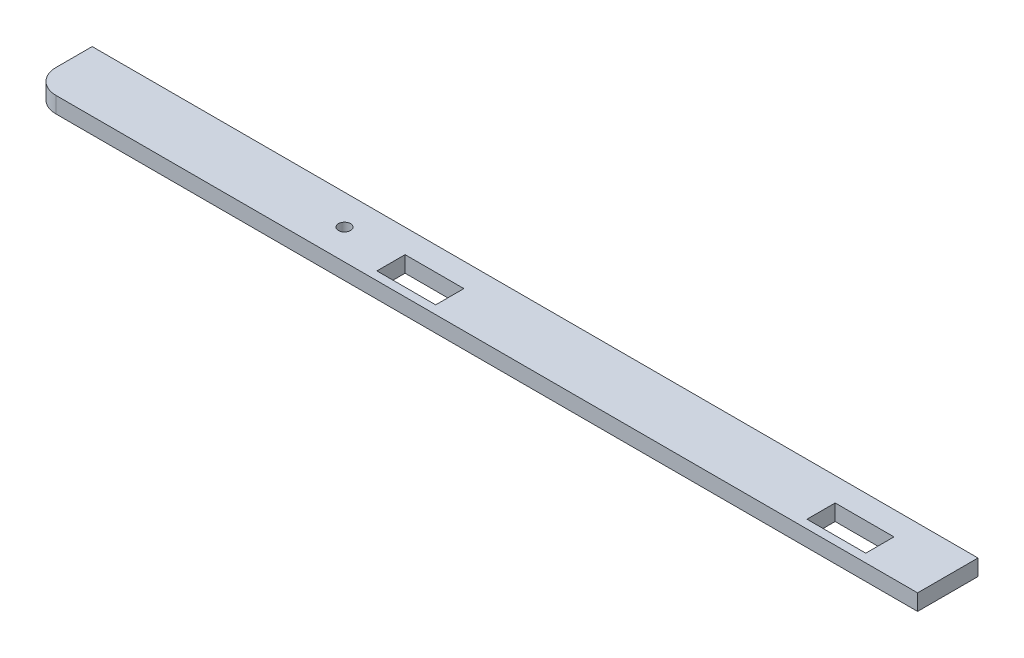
from build123d import *

# Parameters (mm, degrees)
SKETCH1_W           = 219.970675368
SKETCH1_H           = 15
SKETCH1_R           = 1.5
BOSS_EXTRUDE1_DEPTH = 4
SKETCH4_W           = 14.6
SKETCH4_H           = 7
CUT_EXTRUDE3_DEPTH  = 186.844020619
SKETCH5_W           = 14.6
SKETCH5_H           = 7
CUT_EXTRUDE4_DEPTH  = 186.844020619
FILLET1_R           = 6


with BuildPart() as part:
    # Sketch1 → Boss-Extrude1 (new body)
    with BuildSketch(Plane(origin=(0, 3, 0), x_dir=(1, 0, 0), z_dir=(0, 1, 0))):
        with Locations((-31.014662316, -113.5)):
            Rectangle(SKETCH1_W, SKETCH1_H)
        with Locations(Location((-70.85, -113.5, 0), (0, 0, 270))):
            Circle(SKETCH1_R, mode=Mode.SUBTRACT)
    extrude(amount=-BOSS_EXTRUDE1_DEPTH)

    # Sketch4 → Cut-Extrude3 (cut, through all)
    with BuildSketch(Plane(origin=(0, 3, 0), x_dir=(-1, 0, 0), z_dir=(0, 1, 0))):
        with Locations((-56.7, 115.4)):
            Rectangle(SKETCH4_W, SKETCH4_H)
        with BuildLine():
            Line((-57.401923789, 113.9), (-53.4, 113.9))
            ThreePointArc((-53.4, 113.9), (-51.9, 115.4), (-53.4, 116.9))
            Line((-53.4, 116.9), (-57.401923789, 116.9))
            ThreePointArc((-57.401923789, 116.9), (-57, 115.4), (-57.401923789, 113.9))
        make_face(mode=Mode.SUBTRACT)
    extrude(amount=-CUT_EXTRUDE3_DEPTH, mode=Mode.SUBTRACT)


with BuildPart() as body_2:
    # of the pieces the cut leaves, the one that is kept (cut_extrude3_keep)
    add(part.part.solids().sort_by_distance((-141, 3, 121))[0])

    # Sketch5 → Cut-Extrude4 (cut, through all)
    with BuildSketch(Plane.XZ.offset(1)):
        with Locations((-50.1, 115.4)):
            Rectangle(SKETCH5_W, SKETCH5_H)
        with BuildLine():
            Line((-53.4, 113.9), (-49.398076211, 113.9))
            ThreePointArc((-49.398076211, 113.9), (-49.8, 115.4), (-49.398076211, 116.9))
            Line((-49.398076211, 116.9), (-53.4, 116.9))
            ThreePointArc((-53.4, 116.9), (-54.9, 115.4), (-53.4, 113.9))
        make_face(mode=Mode.SUBTRACT)
    extrude(amount=-CUT_EXTRUDE4_DEPTH, mode=Mode.SUBTRACT)


with BuildPart() as body_2_2:
    # of the pieces the cut leaves, the one that is kept (cut_extrude4_keep)
    add(body_2.part.solids().sort_by_distance((-141, 3, 121))[0])

    # Fillet1
    fillet1_edges = [body_2_2.edges().sort_by_distance(p)[0] for p in [
        (-141, 1, 121),
    ]]
    fillet(fillet1_edges, radius=FILLET1_R)


solid = body_2_2.part
